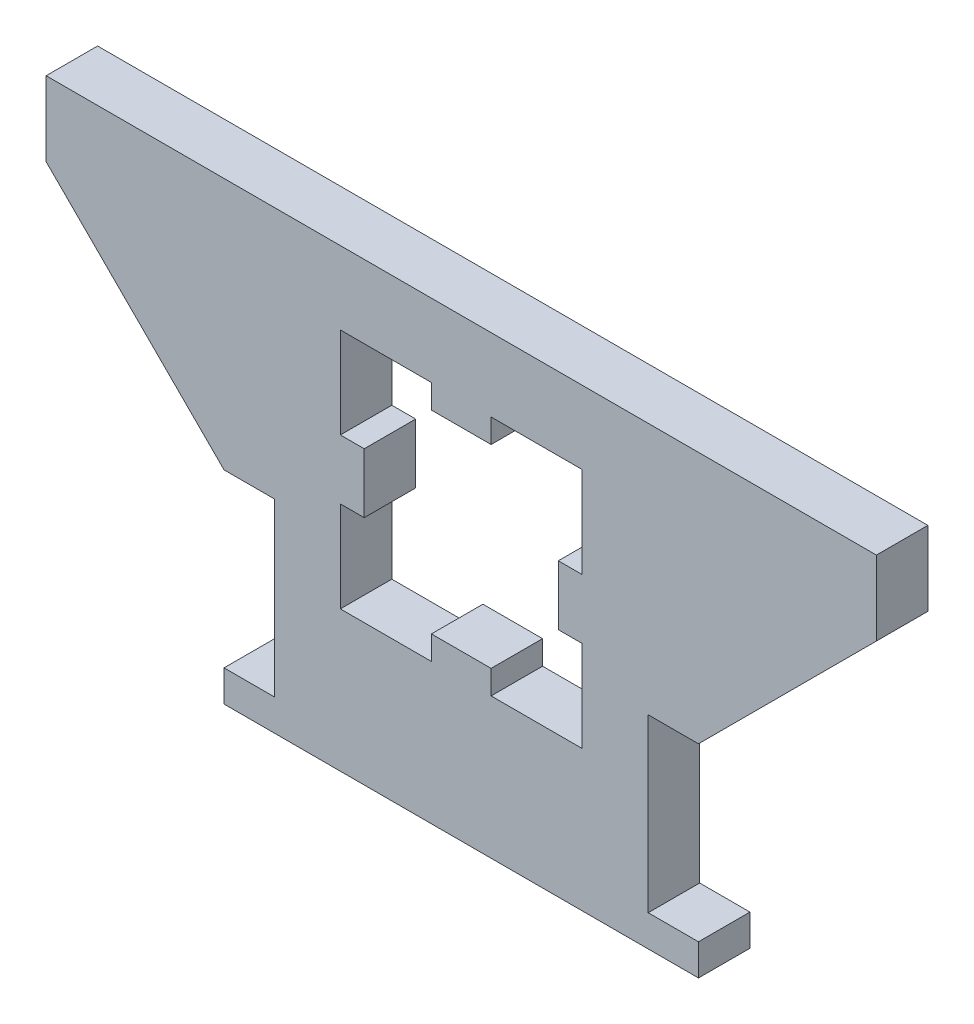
from build123d import *

# Parameters (mm, degrees)
BOSS_EXTRUDE1_DEPTH = 5.5118
BOSS_EXTRUDE2_DEPTH = 5.5118
SKETCH4_W           = 5.3848
SKETCH4_H           = 18.357752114
CUT_EXTRUDE1_DEPTH  = 5.5118
BOSS_EXTRUDE3_DEPTH = 5.5118


with BuildPart() as part:
    # Sketch2 → Boss-Extrude1 (new body)
    with BuildSketch(Plane.XY):
        Polygon((475.637533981, 345.212729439), (475.637533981, 337.238126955), (492.404646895, 337.238126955), (492.404646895, 314.081108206), (492.404646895, 301.381108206), (500.225891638, 301.381108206), (500.225891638, 314.081108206), (500.225891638, 321.263362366), (502.781853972, 321.263362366), (502.781853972, 327.653268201), (500.225891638, 327.653268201), (500.225891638, 334.835522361), (496.391948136, 334.835522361), (496.391948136, 337.238126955), (500.379249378, 341.225428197), (502.781853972, 341.225428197), (502.781853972, 337.391484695), (509.976887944, 337.391484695), (509.976887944, 334.835522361), (516.36679378, 334.835522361), (516.36679378, 337.391484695), (523.561827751, 337.391484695), (523.561827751, 341.225428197), (525.964432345, 341.225428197), (529.951733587, 337.238126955), (529.951733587, 334.835522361), (526.117790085, 334.835522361), (526.117790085, 327.653268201), (523.561827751, 327.653268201), (523.561827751, 321.263362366), (526.117790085, 321.263362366), (526.117790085, 314.081108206), (526.117790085, 301.381108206), (533.939034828, 301.381108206), (533.939034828, 314.081108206), (533.939034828, 337.238126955), (550.706147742, 337.238126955), (550.706147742, 345.212729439), align=None)
    extrude(amount=BOSS_EXTRUDE1_DEPTH)

    # Sketch3 → Boss-Extrude2 (add)
    with BuildSketch(Plane.XY.offset(5.5118)):
        Polygon((492.404646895, 337.238126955), (475.637533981, 337.238126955), (475.637533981, 345.212729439), (468.721840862, 345.212729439), (468.721840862, 337.238126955), (487.771840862, 318.188126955), (487.771840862, 301.381108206), (487.771840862, 296.470900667), (538.571840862, 296.470900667), (538.571840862, 301.381108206), (538.571840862, 318.188126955), (557.621840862, 337.238126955), (557.621840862, 345.212729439), (550.706147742, 345.212729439), (550.706147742, 337.238126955), (533.939034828, 337.238126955), (533.939034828, 301.381108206), (526.117790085, 301.381108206), (526.117790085, 307.69120237), (523.561827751, 307.69120237), (523.561827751, 311.525145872), (516.36679378, 311.525145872), (516.36679378, 314.081108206), (509.976887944, 314.081108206), (509.976887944, 311.525145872), (502.781853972, 311.525145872), (502.781853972, 307.69120237), (500.225891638, 307.69120237), (500.225891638, 301.381108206), (492.404646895, 301.381108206), align=None)
    extrude(amount=-BOSS_EXTRUDE2_DEPTH)

    # Sketch4 → Cut-Extrude1 (cut)
    with BuildSketch(Plane.XY.offset(5.5118)):
        with Locations((535.879440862, 309.009250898)):
            Rectangle(SKETCH4_W, SKETCH4_H)
        with Locations((490.464240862, 309.009250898)):
            Rectangle(SKETCH4_W, SKETCH4_H)
        Polygon((502.781853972, 311.525145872), (502.781853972, 307.69120237), (500.379249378, 307.69120237), (496.391948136, 311.678503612), (496.391948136, 314.081108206), (500.225891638, 314.081108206), align=None)
        Polygon((523.561827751, 307.69120237), (525.964432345, 307.69120237), (529.951733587, 311.678503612), (529.951733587, 314.081108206), (526.117790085, 314.081108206), (523.561827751, 311.525145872), align=None)
    extrude(amount=-CUT_EXTRUDE1_DEPTH, mode=Mode.SUBTRACT)

    # Sketch5 → Boss-Extrude3 (add)
    with BuildSketch(Plane.XY.offset(5.5118)):
        Polygon((500.225891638, 314.081108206), (500.225891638, 311.525145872), (502.781853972, 311.525145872), (502.781853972, 307.134138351), (495.434847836, 307.134138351), (495.434847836, 314.081108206), align=None)
        Polygon((530.908833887, 314.081108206), (526.117790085, 314.081108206), (526.117790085, 311.525145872), (523.561827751, 311.525145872), (523.561827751, 307.134138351), (530.908833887, 307.134138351), align=None)
        Polygon((526.117790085, 334.835522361), (526.117790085, 337.391484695), (523.561827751, 337.391484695), (523.561827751, 341.782492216), (530.908833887, 341.782492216), (530.908833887, 334.835522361), align=None)
        Polygon((495.434847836, 334.835522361), (500.225891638, 334.835522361), (500.225891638, 337.391484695), (502.781853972, 337.391484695), (502.781853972, 341.782492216), (495.434847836, 341.782492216), align=None)
    extrude(amount=-BOSS_EXTRUDE3_DEPTH)


solid = part.part
